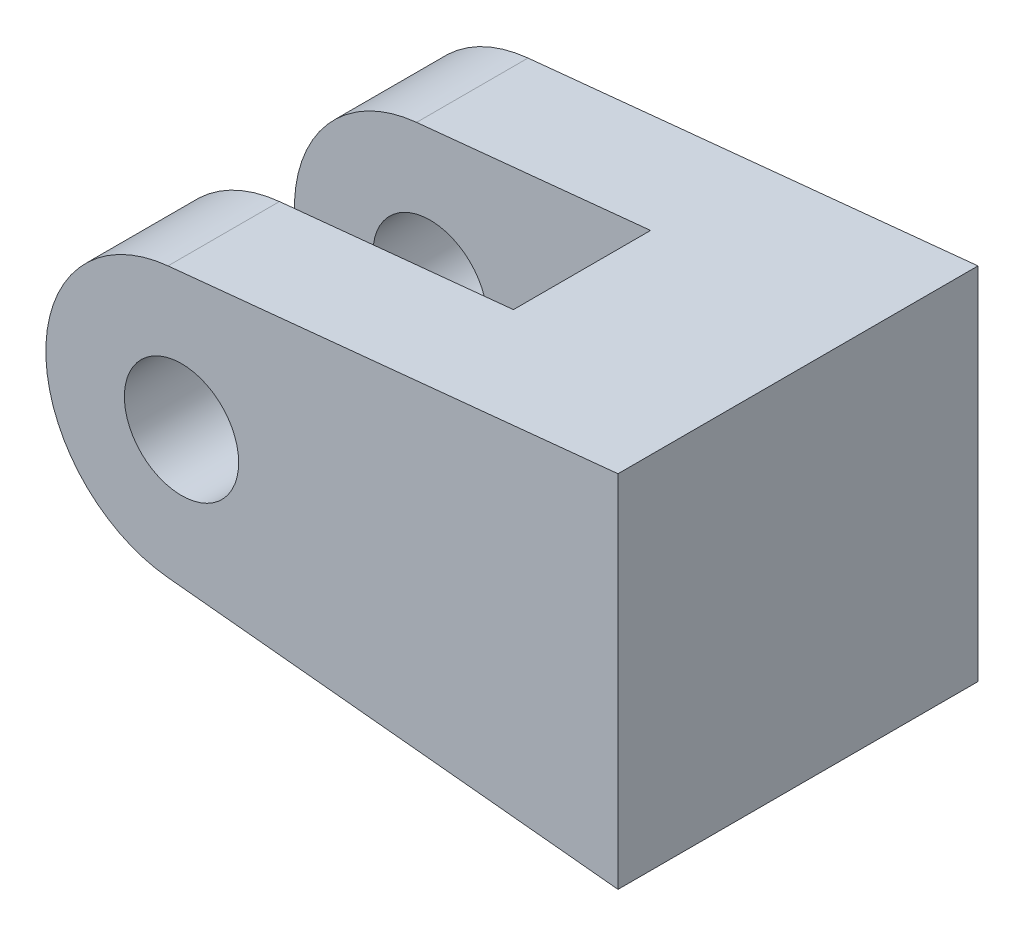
from build123d import *

# Parameters (mm, degrees)
SKETCH1_R               = 3.175
EXTRUDE1_DEPTH          = 20
CUT_EXTRUDE1_DEPTH      = 98.957002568
CUT_EXTRUDE1_DEPTH_BACK = 98.957002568
SKETCH2_W               = 24.345980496
SKETCH2_H               = 7.62


with BuildPart() as part:
    # Sketch1 → Extrude1 (new body)
    with BuildSketch(Plane.XY):
        with BuildLine():
            Line((94.230085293, 2.2161484), (94.230085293, -17.7838516))
            Line((94.230085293, -17.7838516), (69.230085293, -15.2838516))
            ThreePointArc((69.230085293, -15.2838516), (62.442678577, -7.7838516), (69.230085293, -0.2838516))
            Line((69.230085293, -0.2838516), (94.230085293, 2.2161484))
        make_face()
        with Locations((69.980085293, -7.7838516)):
            Circle(SKETCH1_R, mode=Mode.SUBTRACT)
    extrude(amount=EXTRUDE1_DEPTH)

    # Sketch2 → Cut-Extrude1 (cut, two sides: drawn at the far end of the back side and taken through both)
    with BuildSketch(Plane(origin=(0, 0, 0), x_dir=(1, 0, 0), z_dir=(0, 1, 0)).offset(-CUT_EXTRUDE1_DEPTH_BACK)):
        with Locations((70.057095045, -10)):
            Rectangle(SKETCH2_W, SKETCH2_H)
    extrude(amount=CUT_EXTRUDE1_DEPTH + CUT_EXTRUDE1_DEPTH_BACK, mode=Mode.SUBTRACT)


solid = part.part
